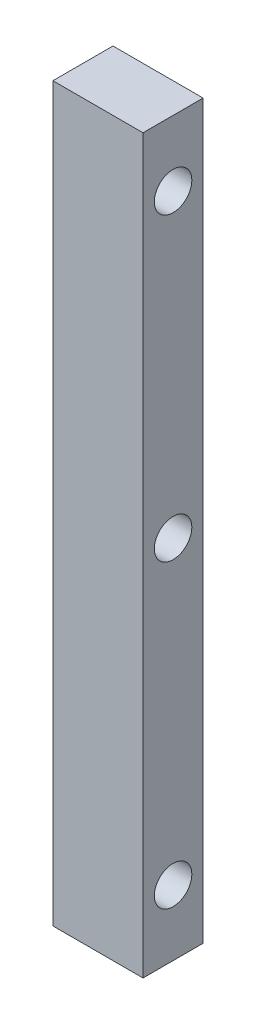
ISO-10303-21;
HEADER;
FILE_DESCRIPTION(('STEP AP214'),'2;1');
FILE_NAME('part.step','',(''),(''),'','','');
FILE_SCHEMA(('AUTOMOTIVE_DESIGN { 1 0 10303 214 1 1 1 1 }'));
ENDSEC;
DATA;
#1=APPLICATION_CONTEXT('core data for automotive mechanical design processes');
#2=APPLICATION_PROTOCOL_DEFINITION('international standard','automotive_design',2000,#1);
#3=PRODUCT_CONTEXT('',#1,'mechanical');
#4=PRODUCT('Part','Part','',(#3));
#5=PRODUCT_RELATED_PRODUCT_CATEGORY('part','',(#4));
#6=PRODUCT_DEFINITION_FORMATION('','',#4);
#7=PRODUCT_DEFINITION_CONTEXT('part definition',#1,'design');
#8=PRODUCT_DEFINITION('design','',#6,#7);
#9=PRODUCT_DEFINITION_SHAPE('','',#8);
#10=(LENGTH_UNIT() NAMED_UNIT(*) SI_UNIT(.MILLI.,.METRE.));
#11=(NAMED_UNIT(*) PLANE_ANGLE_UNIT() SI_UNIT($,.RADIAN.));
#12=(NAMED_UNIT(*) SI_UNIT($,.STERADIAN.) SOLID_ANGLE_UNIT());
#13=UNCERTAINTY_MEASURE_WITH_UNIT(LENGTH_MEASURE(1.E-05),#10,'distance_accuracy_value','');
#14=(GEOMETRIC_REPRESENTATION_CONTEXT(3) GLOBAL_UNCERTAINTY_ASSIGNED_CONTEXT((#13)) GLOBAL_UNIT_ASSIGNED_CONTEXT((#10,
#11,#12)) REPRESENTATION_CONTEXT('',''));
#15=CARTESIAN_POINT('',(0.,0.,0.));
#16=DIRECTION('',(0.,0.,1.));
#17=DIRECTION('',(1.,0.,0.));
#18=AXIS2_PLACEMENT_3D('',#15,#16,#17);
#19=CARTESIAN_POINT('',(-19.05,77.343,-12.6999999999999));
#20=DIRECTION('',(0.,0.,1.00000000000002));
#21=DIRECTION('',(1.,0.,0.));
#22=AXIS2_PLACEMENT_3D('',#19,#20,#21);
#23=PLANE('',#22);
#24=DIRECTION('',(0.,-1.00000000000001,0.));
#25=VECTOR('',#24,1.);
#26=CARTESIAN_POINT('',(0.,77.343,-12.6999999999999));
#27=LINE('',#26,#25);
#28=CARTESIAN_POINT('',(0.,77.343,-12.6999999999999));
#29=VERTEX_POINT('',#28);
#30=CARTESIAN_POINT('',(0.,-77.3430000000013,-12.6999999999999));
#31=VERTEX_POINT('',#30);
#32=EDGE_CURVE('E87',#29,#31,#27,.T.);
#33=ORIENTED_EDGE('',*,*,#32,.T.);
#34=DIRECTION('',(-1.,0.,0.));
#35=VECTOR('',#34,1.);
#36=CARTESIAN_POINT('',(-19.05,-77.3430000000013,-12.6999999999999));
#37=LINE('',#36,#35);
#38=CARTESIAN_POINT('',(-19.05,-77.3430000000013,-12.6999999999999));
#39=VERTEX_POINT('',#38);
#40=EDGE_CURVE('E82',#31,#39,#37,.T.);
#41=ORIENTED_EDGE('',*,*,#40,.T.);
#42=DIRECTION('',(0.,-1.00000000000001,0.));
#43=VECTOR('',#42,1.);
#44=CARTESIAN_POINT('',(-19.05,77.343,-12.6999999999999));
#45=LINE('',#44,#43);
#46=CARTESIAN_POINT('',(-19.05,77.343,-12.6999999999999));
#47=VERTEX_POINT('',#46);
#48=EDGE_CURVE('E11',#47,#39,#45,.T.);
#49=ORIENTED_EDGE('',*,*,#48,.F.);
#50=DIRECTION('',(-1.,0.,0.));
#51=VECTOR('',#50,1.);
#52=CARTESIAN_POINT('',(-19.05,77.343,-12.6999999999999));
#53=LINE('',#52,#51);
#54=EDGE_CURVE('E98',#29,#47,#53,.T.);
#55=ORIENTED_EDGE('',*,*,#54,.F.);
#56=EDGE_LOOP('',(#33,#41,#49,#55));
#57=FACE_BOUND('',#56,.T.);
#58=ADVANCED_FACE('F30',(#57),#23,.F.);
#59=CARTESIAN_POINT('',(-19.05,77.3430000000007,0.));
#60=DIRECTION('',(1.,0.,0.));
#61=DIRECTION('',(0.,0.,-1.00000000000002));
#62=AXIS2_PLACEMENT_3D('',#59,#60,#61);
#63=PLANE('',#62);
#64=CARTESIAN_POINT('',(-19.05,-63.5000000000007,-6.34999999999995));
#65=DIRECTION('',(1.,0.,0.));
#66=DIRECTION('',(0.,0.,-1.00000000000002));
#67=AXIS2_PLACEMENT_3D('',#64,#65,#66);
#68=CIRCLE('',#67,3.9624);
#69=CARTESIAN_POINT('',(-19.05,-63.5000000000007,-10.3124));
#70=VERTEX_POINT('',#69);
#71=EDGE_CURVE('E132',#70,#70,#68,.T.);
#72=ORIENTED_EDGE('',*,*,#71,.T.);
#73=EDGE_LOOP('',(#72));
#74=FACE_BOUND('',#73,.T.);
#75=CARTESIAN_POINT('',(-19.05,0.,-6.34999999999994));
#76=DIRECTION('',(1.,0.,0.));
#77=DIRECTION('',(0.,0.,-1.00000000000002));
#78=AXIS2_PLACEMENT_3D('',#75,#76,#77);
#79=CIRCLE('',#78,3.9624);
#80=CARTESIAN_POINT('',(-19.05,0.,-10.3124));
#81=VERTEX_POINT('',#80);
#82=EDGE_CURVE('E136',#81,#81,#79,.T.);
#83=ORIENTED_EDGE('',*,*,#82,.T.);
#84=EDGE_LOOP('',(#83));
#85=FACE_BOUND('',#84,.T.);
#86=CARTESIAN_POINT('',(-19.05,63.5000000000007,-6.3499999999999));
#87=DIRECTION('',(1.,0.,0.));
#88=DIRECTION('',(0.,0.,-1.00000000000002));
#89=AXIS2_PLACEMENT_3D('',#86,#87,#88);
#90=CIRCLE('',#89,3.9624);
#91=CARTESIAN_POINT('',(-19.05,63.5000000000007,-10.3124));
#92=VERTEX_POINT('',#91);
#93=EDGE_CURVE('E88',#92,#92,#90,.T.);
#94=ORIENTED_EDGE('',*,*,#93,.T.);
#95=EDGE_LOOP('',(#94));
#96=FACE_BOUND('',#95,.T.);
#97=ORIENTED_EDGE('',*,*,#48,.T.);
#98=DIRECTION('',(0.,0.,1.00000000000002));
#99=VECTOR('',#98,1.);
#100=CARTESIAN_POINT('',(-19.0500000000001,-77.3430000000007,0.));
#101=LINE('',#100,#99);
#102=CARTESIAN_POINT('',(-19.0500000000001,-77.3430000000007,0.));
#103=VERTEX_POINT('',#102);
#104=EDGE_CURVE('E72',#39,#103,#101,.T.);
#105=ORIENTED_EDGE('',*,*,#104,.T.);
#106=DIRECTION('',(0.,-1.00000000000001,0.));
#107=VECTOR('',#106,1.);
#108=CARTESIAN_POINT('',(-19.05,77.3430000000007,0.));
#109=LINE('',#108,#107);
#110=CARTESIAN_POINT('',(-19.05,77.3430000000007,0.));
#111=VERTEX_POINT('',#110);
#112=EDGE_CURVE('E37',#111,#103,#109,.T.);
#113=ORIENTED_EDGE('',*,*,#112,.F.);
#114=DIRECTION('',(0.,0.,1.00000000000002));
#115=VECTOR('',#114,1.);
#116=CARTESIAN_POINT('',(-19.05,77.3430000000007,0.));
#117=LINE('',#116,#115);
#118=EDGE_CURVE('E73',#47,#111,#117,.T.);
#119=ORIENTED_EDGE('',*,*,#118,.F.);
#120=EDGE_LOOP('',(#97,#105,#113,#119));
#121=FACE_BOUND('',#120,.T.);
#122=ADVANCED_FACE('F70',(#74,#85,#96,#121),#63,.F.);
#123=CARTESIAN_POINT('',(-19.05,77.3430000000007,0.));
#124=DIRECTION('',(0.,0.,-1.00000000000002));
#125=DIRECTION('',(-1.,0.,0.));
#126=AXIS2_PLACEMENT_3D('',#123,#124,#125);
#127=PLANE('',#126);
#128=ORIENTED_EDGE('',*,*,#112,.T.);
#129=DIRECTION('',(1.,0.,0.));
#130=VECTOR('',#129,1.);
#131=CARTESIAN_POINT('',(-19.0500000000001,-77.3430000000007,0.));
#132=LINE('',#131,#130);
#133=CARTESIAN_POINT('',(0.,-77.3430000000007,0.));
#134=VERTEX_POINT('',#133);
#135=EDGE_CURVE('E85',#103,#134,#132,.T.);
#136=ORIENTED_EDGE('',*,*,#135,.T.);
#137=DIRECTION('',(0.,-1.00000000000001,0.));
#138=VECTOR('',#137,1.);
#139=CARTESIAN_POINT('',(0.,77.3430000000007,0.));
#140=LINE('',#139,#138);
#141=CARTESIAN_POINT('',(0.,77.3430000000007,0.));
#142=VERTEX_POINT('',#141);
#143=EDGE_CURVE('E104',#142,#134,#140,.T.);
#144=ORIENTED_EDGE('',*,*,#143,.F.);
#145=DIRECTION('',(1.,0.,0.));
#146=VECTOR('',#145,1.);
#147=CARTESIAN_POINT('',(-19.05,77.3430000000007,0.));
#148=LINE('',#147,#146);
#149=EDGE_CURVE('E49',#111,#142,#148,.T.);
#150=ORIENTED_EDGE('',*,*,#149,.F.);
#151=EDGE_LOOP('',(#128,#136,#144,#150));
#152=FACE_BOUND('',#151,.T.);
#153=ADVANCED_FACE('F106',(#152),#127,.F.);
#154=CARTESIAN_POINT('',(0.,77.343,-12.6999999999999));
#155=DIRECTION('',(-1.,0.,0.));
#156=DIRECTION('',(0.,0.,1.00000000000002));
#157=AXIS2_PLACEMENT_3D('',#154,#155,#156);
#158=PLANE('',#157);
#159=CARTESIAN_POINT('',(0.,-63.5000000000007,-6.34999999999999));
#160=DIRECTION('',(1.,0.,0.));
#161=DIRECTION('',(0.,0.,-1.00000000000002));
#162=AXIS2_PLACEMENT_3D('',#159,#160,#161);
#163=CIRCLE('',#162,3.9624);
#164=CARTESIAN_POINT('',(0.,-63.5000000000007,-10.3124));
#165=VERTEX_POINT('',#164);
#166=EDGE_CURVE('E152',#165,#165,#163,.T.);
#167=ORIENTED_EDGE('',*,*,#166,.F.);
#168=EDGE_LOOP('',(#167));
#169=FACE_BOUND('',#168,.T.);
#170=CARTESIAN_POINT('',(0.,0.,-6.35000000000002));
#171=DIRECTION('',(1.,0.,0.));
#172=DIRECTION('',(0.,0.,-1.00000000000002));
#173=AXIS2_PLACEMENT_3D('',#170,#171,#172);
#174=CIRCLE('',#173,3.9624);
#175=CARTESIAN_POINT('',(0.,0.,-10.3124));
#176=VERTEX_POINT('',#175);
#177=EDGE_CURVE('E146',#176,#176,#174,.T.);
#178=ORIENTED_EDGE('',*,*,#177,.F.);
#179=EDGE_LOOP('',(#178));
#180=FACE_BOUND('',#179,.T.);
#181=CARTESIAN_POINT('',(-2.4980018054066E-13,63.5000000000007,-6.34999999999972));
#182=DIRECTION('',(1.,0.,0.));
#183=DIRECTION('',(0.,0.,-1.00000000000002));
#184=AXIS2_PLACEMENT_3D('',#181,#182,#183);
#185=CIRCLE('',#184,3.9624);
#186=CARTESIAN_POINT('',(-2.53269627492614E-13,63.5000000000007,-10.3124));
#187=VERTEX_POINT('',#186);
#188=EDGE_CURVE('E91',#187,#187,#185,.T.);
#189=ORIENTED_EDGE('',*,*,#188,.F.);
#190=EDGE_LOOP('',(#189));
#191=FACE_BOUND('',#190,.T.);
#192=ORIENTED_EDGE('',*,*,#143,.T.);
#193=DIRECTION('',(0.,0.,-1.00000000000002));
#194=VECTOR('',#193,1.);
#195=CARTESIAN_POINT('',(0.,-77.3430000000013,-12.6999999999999));
#196=LINE('',#195,#194);
#197=EDGE_CURVE('E96',#134,#31,#196,.T.);
#198=ORIENTED_EDGE('',*,*,#197,.T.);
#199=ORIENTED_EDGE('',*,*,#32,.F.);
#200=DIRECTION('',(0.,0.,-1.00000000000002));
#201=VECTOR('',#200,1.);
#202=CARTESIAN_POINT('',(0.,77.343,-12.6999999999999));
#203=LINE('',#202,#201);
#204=EDGE_CURVE('E44',#142,#29,#203,.T.);
#205=ORIENTED_EDGE('',*,*,#204,.F.);
#206=EDGE_LOOP('',(#192,#198,#199,#205));
#207=FACE_BOUND('',#206,.T.);
#208=ADVANCED_FACE('F108',(#169,#180,#191,#207),#158,.F.);
#209=CARTESIAN_POINT('',(0.,77.343,-12.6999999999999));
#210=DIRECTION('',(0.,-1.00000000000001,0.));
#211=DIRECTION('',(0.,0.,-1.00000000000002));
#212=AXIS2_PLACEMENT_3D('',#209,#210,#211);
#213=PLANE('',#212);
#214=ORIENTED_EDGE('',*,*,#54,.T.);
#215=ORIENTED_EDGE('',*,*,#118,.T.);
#216=ORIENTED_EDGE('',*,*,#149,.T.);
#217=ORIENTED_EDGE('',*,*,#204,.T.);
#218=EDGE_LOOP('',(#214,#215,#216,#217));
#219=FACE_BOUND('',#218,.T.);
#220=ADVANCED_FACE('F109',(#219),#213,.F.);
#221=CARTESIAN_POINT('',(0.,-77.3430000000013,-12.6999999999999));
#222=DIRECTION('',(0.,-1.00000000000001,0.));
#223=DIRECTION('',(0.,0.,-1.00000000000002));
#224=AXIS2_PLACEMENT_3D('',#221,#222,#223);
#225=PLANE('',#224);
#226=ORIENTED_EDGE('',*,*,#40,.F.);
#227=ORIENTED_EDGE('',*,*,#197,.F.);
#228=ORIENTED_EDGE('',*,*,#135,.F.);
#229=ORIENTED_EDGE('',*,*,#104,.F.);
#230=EDGE_LOOP('',(#226,#227,#228,#229));
#231=FACE_BOUND('',#230,.T.);
#232=ADVANCED_FACE('F80',(#231),#225,.T.);
#233=CARTESIAN_POINT('',(-19.05,63.5000000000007,-6.3499999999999));
#234=DIRECTION('',(1.,0.,0.));
#235=DIRECTION('',(0.,0.,-1.00000000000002));
#236=AXIS2_PLACEMENT_3D('',#233,#234,#235);
#237=CYLINDRICAL_SURFACE('',#236,3.9624);
#238=CARTESIAN_POINT('',(-19.05,63.5000000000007,-10.3124));
#239=CARTESIAN_POINT('',(-18.8515625,63.5000000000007,-10.3124));
#240=CARTESIAN_POINT('',(-18.653125,63.5000000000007,-10.3124));
#241=CARTESIAN_POINT('',(-18.25625,63.5000000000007,-10.3124));
#242=CARTESIAN_POINT('',(-18.0578125,63.5000000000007,-10.3124));
#243=CARTESIAN_POINT('',(-17.6609375,63.5000000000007,-10.3124));
#244=CARTESIAN_POINT('',(-17.4625,63.5000000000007,-10.3124));
#245=CARTESIAN_POINT('',(-17.065625,63.5000000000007,-10.3124));
#246=CARTESIAN_POINT('',(-16.8671875,63.5000000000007,-10.3124));
#247=CARTESIAN_POINT('',(-16.4703125,63.5000000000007,-10.3124));
#248=CARTESIAN_POINT('',(-16.2718750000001,63.5000000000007,-10.3124));
#249=CARTESIAN_POINT('',(-15.8750000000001,63.5000000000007,-10.3124));
#250=CARTESIAN_POINT('',(-15.6765625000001,63.5000000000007,-10.3124));
#251=CARTESIAN_POINT('',(-15.2796875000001,63.5000000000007,-10.3124));
#252=CARTESIAN_POINT('',(-15.0812500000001,63.5000000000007,-10.3124));
#253=CARTESIAN_POINT('',(-14.6843750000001,63.5000000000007,-10.3124));
#254=CARTESIAN_POINT('',(-14.4859375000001,63.5000000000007,-10.3124));
#255=CARTESIAN_POINT('',(-14.0890625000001,63.5000000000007,-10.3124));
#256=CARTESIAN_POINT('',(-13.8906250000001,63.5000000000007,-10.3124));
#257=CARTESIAN_POINT('',(-13.4937500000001,63.5000000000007,-10.3124));
#258=CARTESIAN_POINT('',(-13.2953125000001,63.5000000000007,-10.3124));
#259=CARTESIAN_POINT('',(-12.8984375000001,63.5000000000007,-10.3124));
#260=CARTESIAN_POINT('',(-12.7000000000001,63.5000000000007,-10.3124));
#261=CARTESIAN_POINT('',(-12.3031250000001,63.5000000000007,-10.3124));
#262=CARTESIAN_POINT('',(-12.1046875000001,63.5000000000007,-10.3124));
#263=CARTESIAN_POINT('',(-11.7078125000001,63.5000000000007,-10.3124));
#264=CARTESIAN_POINT('',(-11.5093750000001,63.5000000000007,-10.3124));
#265=CARTESIAN_POINT('',(-11.1125000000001,63.5000000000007,-10.3124));
#266=CARTESIAN_POINT('',(-10.9140625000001,63.5000000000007,-10.3124));
#267=CARTESIAN_POINT('',(-10.5171875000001,63.5000000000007,-10.3124));
#268=CARTESIAN_POINT('',(-10.3187500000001,63.5000000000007,-10.3124));
#269=CARTESIAN_POINT('',(-9.92187500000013,63.5000000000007,-10.3124));
#270=CARTESIAN_POINT('',(-9.72343750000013,63.5000000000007,-10.3124));
#271=CARTESIAN_POINT('',(-9.32656250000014,63.5000000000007,-10.3124));
#272=CARTESIAN_POINT('',(-9.12812500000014,63.5000000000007,-10.3124));
#273=CARTESIAN_POINT('',(-8.73125000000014,63.5000000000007,-10.3124));
#274=CARTESIAN_POINT('',(-8.53281250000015,63.5000000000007,-10.3124));
#275=CARTESIAN_POINT('',(-8.13593750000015,63.5000000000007,-10.3124));
#276=CARTESIAN_POINT('',(-7.93750000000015,63.5000000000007,-10.3124));
#277=CARTESIAN_POINT('',(-7.54062500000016,63.5000000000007,-10.3124));
#278=CARTESIAN_POINT('',(-7.34218750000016,63.5000000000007,-10.3124));
#279=CARTESIAN_POINT('',(-6.94531250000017,63.5000000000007,-10.3124));
#280=CARTESIAN_POINT('',(-6.74687500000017,63.5000000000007,-10.3124));
#281=CARTESIAN_POINT('',(-6.35000000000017,63.5000000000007,-10.3124));
#282=CARTESIAN_POINT('',(-6.15156250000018,63.5000000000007,-10.3124));
#283=CARTESIAN_POINT('',(-5.75468750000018,63.5000000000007,-10.3124));
#284=CARTESIAN_POINT('',(-5.55625000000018,63.5000000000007,-10.3124));
#285=CARTESIAN_POINT('',(-5.15937500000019,63.5000000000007,-10.3124));
#286=CARTESIAN_POINT('',(-4.96093750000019,63.5000000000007,-10.3124));
#287=CARTESIAN_POINT('',(-4.5640625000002,63.5000000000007,-10.3124));
#288=CARTESIAN_POINT('',(-4.3656250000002,63.5000000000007,-10.3124));
#289=CARTESIAN_POINT('',(-3.9687500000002,63.5000000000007,-10.3124));
#290=CARTESIAN_POINT('',(-3.77031250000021,63.5000000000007,-10.3124));
#291=CARTESIAN_POINT('',(-3.37343750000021,63.5000000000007,-10.3124));
#292=CARTESIAN_POINT('',(-3.17500000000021,63.5000000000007,-10.3124));
#293=CARTESIAN_POINT('',(-2.77812500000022,63.5000000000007,-10.3124));
#294=CARTESIAN_POINT('',(-2.57968750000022,63.5000000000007,-10.3124));
#295=CARTESIAN_POINT('',(-2.18281250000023,63.5000000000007,-10.3124));
#296=CARTESIAN_POINT('',(-1.98437500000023,63.5000000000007,-10.3124));
#297=CARTESIAN_POINT('',(-1.58750000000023,63.5000000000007,-10.3124));
#298=CARTESIAN_POINT('',(-1.38906250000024,63.5000000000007,-10.3124));
#299=CARTESIAN_POINT('',(-0.992187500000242,63.5000000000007,-10.3124));
#300=CARTESIAN_POINT('',(-0.793750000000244,63.5000000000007,-10.3124));
#301=CARTESIAN_POINT('',(-0.396875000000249,63.5000000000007,-10.3124));
#302=CARTESIAN_POINT('',(-0.198437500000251,63.5000000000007,-10.3124));
#303=CARTESIAN_POINT('',(-2.53269627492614E-13,63.5000000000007,-10.3124));
#304=B_SPLINE_CURVE_WITH_KNOTS('',3,(#238,#239,#240,#241,#242,#243,#244,#245,#246,#247,#248,
#249,#250,#251,#252,#253,#254,#255,#256,#257,#258,#259,#260,#261,#262,#263,#264,#265,#266,#267,
#268,#269,#270,#271,#272,#273,#274,#275,#276,#277,#278,#279,#280,#281,#282,#283,#284,#285,#286,
#287,#288,#289,#290,#291,#292,#293,#294,#295,#296,#297,#298,#299,#300,#301,#302,#303),
.UNSPECIFIED.,.F.,.F.,(4,2,2,2,2,2,2,2,2,2,2,2,2,2,2,2,2,2,2,2,2,2,2,2,2,2,2,2,2,2,2,2,4),(0.,
0.59531249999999,1.19062499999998,1.78593749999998,2.38124999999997,2.97656249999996,
3.57187499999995,4.16718749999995,4.76249999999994,5.35781249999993,5.95312499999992,
6.54843749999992,7.14374999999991,7.7390624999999,8.33437499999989,8.92968749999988,
9.52499999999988,10.1203124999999,10.7156249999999,11.3109374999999,11.9062499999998,
12.5015624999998,13.0968749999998,13.6921874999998,14.2874999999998,14.8828124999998,
15.4781249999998,16.0734374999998,16.6687499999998,17.2640624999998,17.8593749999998,
18.4546874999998,19.0499999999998),.UNSPECIFIED.);
#305=EDGE_CURVE('BSEAM116',#92,#187,#304,.T.);
#306=ORIENTED_EDGE('',*,*,#93,.F.);
#307=ORIENTED_EDGE('',*,*,#188,.T.);
#308=ORIENTED_EDGE('',*,*,#305,.T.);
#309=ORIENTED_EDGE('',*,*,#305,.F.);
#310=EDGE_LOOP('',(#306,#308,#307,#309));
#311=FACE_BOUND('',#310,.T.);
#312=ADVANCED_FACE('F116',(#311),#237,.F.);
#313=CARTESIAN_POINT('',(-19.05,0.,-6.34999999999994));
#314=DIRECTION('',(1.,0.,0.));
#315=DIRECTION('',(0.,0.,-1.00000000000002));
#316=AXIS2_PLACEMENT_3D('',#313,#314,#315);
#317=CYLINDRICAL_SURFACE('',#316,3.9624);
#318=CARTESIAN_POINT('',(-19.05,0.,-10.3124));
#319=CARTESIAN_POINT('',(-18.8515625,0.,-10.3124));
#320=CARTESIAN_POINT('',(-18.653125,0.,-10.3124));
#321=CARTESIAN_POINT('',(-18.25625,0.,-10.3124));
#322=CARTESIAN_POINT('',(-18.0578125,0.,-10.3124));
#323=CARTESIAN_POINT('',(-17.6609375,0.,-10.3124));
#324=CARTESIAN_POINT('',(-17.4625,0.,-10.3124));
#325=CARTESIAN_POINT('',(-17.065625,0.,-10.3124));
#326=CARTESIAN_POINT('',(-16.8671875,0.,-10.3124));
#327=CARTESIAN_POINT('',(-16.4703125,0.,-10.3124));
#328=CARTESIAN_POINT('',(-16.271875,0.,-10.3124));
#329=CARTESIAN_POINT('',(-15.875,0.,-10.3124));
#330=CARTESIAN_POINT('',(-15.6765625,0.,-10.3124));
#331=CARTESIAN_POINT('',(-15.2796875,0.,-10.3124));
#332=CARTESIAN_POINT('',(-15.08125,0.,-10.3124));
#333=CARTESIAN_POINT('',(-14.684375,0.,-10.3124));
#334=CARTESIAN_POINT('',(-14.4859375,0.,-10.3124));
#335=CARTESIAN_POINT('',(-14.0890625,0.,-10.3124));
#336=CARTESIAN_POINT('',(-13.890625,0.,-10.3124));
#337=CARTESIAN_POINT('',(-13.49375,0.,-10.3124));
#338=CARTESIAN_POINT('',(-13.2953125,0.,-10.3124));
#339=CARTESIAN_POINT('',(-12.8984375,0.,-10.3124));
#340=CARTESIAN_POINT('',(-12.7,0.,-10.3124));
#341=CARTESIAN_POINT('',(-12.303125,0.,-10.3124));
#342=CARTESIAN_POINT('',(-12.1046875,0.,-10.3124));
#343=CARTESIAN_POINT('',(-11.7078125,0.,-10.3124));
#344=CARTESIAN_POINT('',(-11.509375,0.,-10.3124));
#345=CARTESIAN_POINT('',(-11.1125,0.,-10.3124));
#346=CARTESIAN_POINT('',(-10.9140625,0.,-10.3124));
#347=CARTESIAN_POINT('',(-10.5171875,0.,-10.3124));
#348=CARTESIAN_POINT('',(-10.31875,0.,-10.3124));
#349=CARTESIAN_POINT('',(-9.92187500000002,0.,-10.3124));
#350=CARTESIAN_POINT('',(-9.72343750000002,0.,-10.3124));
#351=CARTESIAN_POINT('',(-9.32656250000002,0.,-10.3124));
#352=CARTESIAN_POINT('',(-9.12812500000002,0.,-10.3124));
#353=CARTESIAN_POINT('',(-8.73125000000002,0.,-10.3124));
#354=CARTESIAN_POINT('',(-8.53281250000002,0.,-10.3124));
#355=CARTESIAN_POINT('',(-8.13593750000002,0.,-10.3124));
#356=CARTESIAN_POINT('',(-7.93750000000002,0.,-10.3124));
#357=CARTESIAN_POINT('',(-7.54062500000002,0.,-10.3124));
#358=CARTESIAN_POINT('',(-7.34218750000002,0.,-10.3124));
#359=CARTESIAN_POINT('',(-6.94531250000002,0.,-10.3124));
#360=CARTESIAN_POINT('',(-6.74687500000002,0.,-10.3124));
#361=CARTESIAN_POINT('',(-6.35000000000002,0.,-10.3124));
#362=CARTESIAN_POINT('',(-6.15156250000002,0.,-10.3124));
#363=CARTESIAN_POINT('',(-5.75468750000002,0.,-10.3124));
#364=CARTESIAN_POINT('',(-5.55625000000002,0.,-10.3124));
#365=CARTESIAN_POINT('',(-5.15937500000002,0.,-10.3124));
#366=CARTESIAN_POINT('',(-4.96093750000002,0.,-10.3124));
#367=CARTESIAN_POINT('',(-4.56406250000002,0.,-10.3124));
#368=CARTESIAN_POINT('',(-4.36562500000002,0.,-10.3124));
#369=CARTESIAN_POINT('',(-3.96875000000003,0.,-10.3124));
#370=CARTESIAN_POINT('',(-3.77031250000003,0.,-10.3124));
#371=CARTESIAN_POINT('',(-3.37343750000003,0.,-10.3124));
#372=CARTESIAN_POINT('',(-3.17500000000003,0.,-10.3124));
#373=CARTESIAN_POINT('',(-2.77812500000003,0.,-10.3124));
#374=CARTESIAN_POINT('',(-2.57968750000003,0.,-10.3124));
#375=CARTESIAN_POINT('',(-2.18281250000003,0.,-10.3124));
#376=CARTESIAN_POINT('',(-1.98437500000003,0.,-10.3124));
#377=CARTESIAN_POINT('',(-1.58750000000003,0.,-10.3124));
#378=CARTESIAN_POINT('',(-1.38906250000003,0.,-10.3124));
#379=CARTESIAN_POINT('',(-0.992187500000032,0.,-10.3124));
#380=CARTESIAN_POINT('',(-0.793750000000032,0.,-10.3124));
#381=CARTESIAN_POINT('',(-0.396875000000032,0.,-10.3124));
#382=CARTESIAN_POINT('',(-0.198437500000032,0.,-10.3124));
#383=CARTESIAN_POINT('',(0.,0.,-10.3124));
#384=B_SPLINE_CURVE_WITH_KNOTS('',3,(#318,#319,#320,#321,#322,#323,#324,#325,#326,#327,#328,
#329,#330,#331,#332,#333,#334,#335,#336,#337,#338,#339,#340,#341,#342,#343,#344,#345,#346,#347,
#348,#349,#350,#351,#352,#353,#354,#355,#356,#357,#358,#359,#360,#361,#362,#363,#364,#365,#366,
#367,#368,#369,#370,#371,#372,#373,#374,#375,#376,#377,#378,#379,#380,#381,#382,#383),
.UNSPECIFIED.,.F.,.F.,(4,2,2,2,2,2,2,2,2,2,2,2,2,2,2,2,2,2,2,2,2,2,2,2,2,2,2,2,2,2,2,2,4),(0.,
0.5953125,1.190625,1.7859375,2.38125,2.9765625,3.571875,4.1671875,4.7625,5.3578125,5.953125,
6.5484375,7.14375,7.7390625,8.33437499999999,8.92968749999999,9.52499999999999,10.1203125,
10.715625,11.3109375,11.90625,12.5015625,13.096875,13.6921875,14.2875,14.8828125,15.478125,
16.0734375,16.66875,17.2640625,17.859375,18.4546875,19.05),.UNSPECIFIED.);
#385=EDGE_CURVE('BSEAM141',#81,#176,#384,.T.);
#386=ORIENTED_EDGE('',*,*,#82,.F.);
#387=ORIENTED_EDGE('',*,*,#177,.T.);
#388=ORIENTED_EDGE('',*,*,#385,.T.);
#389=ORIENTED_EDGE('',*,*,#385,.F.);
#390=EDGE_LOOP('',(#386,#388,#387,#389));
#391=FACE_BOUND('',#390,.T.);
#392=ADVANCED_FACE('F141',(#391),#317,.F.);
#393=CARTESIAN_POINT('',(-19.05,-63.5000000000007,-6.34999999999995));
#394=DIRECTION('',(1.,0.,0.));
#395=DIRECTION('',(0.,0.,-1.00000000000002));
#396=AXIS2_PLACEMENT_3D('',#393,#394,#395);
#397=CYLINDRICAL_SURFACE('',#396,3.9624);
#398=CARTESIAN_POINT('',(-19.05,-63.5000000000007,-10.3124));
#399=CARTESIAN_POINT('',(-18.8515625,-63.5000000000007,-10.3124));
#400=CARTESIAN_POINT('',(-18.653125,-63.5000000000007,-10.3124));
#401=CARTESIAN_POINT('',(-18.25625,-63.5000000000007,-10.3124));
#402=CARTESIAN_POINT('',(-18.0578125,-63.5000000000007,-10.3124));
#403=CARTESIAN_POINT('',(-17.6609375,-63.5000000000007,-10.3124));
#404=CARTESIAN_POINT('',(-17.4625,-63.5000000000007,-10.3124));
#405=CARTESIAN_POINT('',(-17.065625,-63.5000000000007,-10.3124));
#406=CARTESIAN_POINT('',(-16.8671875,-63.5000000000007,-10.3124));
#407=CARTESIAN_POINT('',(-16.4703125,-63.5000000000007,-10.3124));
#408=CARTESIAN_POINT('',(-16.271875,-63.5000000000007,-10.3124));
#409=CARTESIAN_POINT('',(-15.875,-63.5000000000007,-10.3124));
#410=CARTESIAN_POINT('',(-15.6765625,-63.5000000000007,-10.3124));
#411=CARTESIAN_POINT('',(-15.2796875,-63.5000000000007,-10.3124));
#412=CARTESIAN_POINT('',(-15.08125,-63.5000000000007,-10.3124));
#413=CARTESIAN_POINT('',(-14.6843750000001,-63.5000000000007,-10.3124));
#414=CARTESIAN_POINT('',(-14.4859375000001,-63.5000000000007,-10.3124));
#415=CARTESIAN_POINT('',(-14.0890625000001,-63.5000000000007,-10.3124));
#416=CARTESIAN_POINT('',(-13.8906250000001,-63.5000000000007,-10.3124));
#417=CARTESIAN_POINT('',(-13.4937500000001,-63.5000000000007,-10.3124));
#418=CARTESIAN_POINT('',(-13.2953125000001,-63.5000000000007,-10.3124));
#419=CARTESIAN_POINT('',(-12.8984375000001,-63.5000000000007,-10.3124));
#420=CARTESIAN_POINT('',(-12.7000000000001,-63.5000000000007,-10.3124));
#421=CARTESIAN_POINT('',(-12.3031250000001,-63.5000000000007,-10.3124));
#422=CARTESIAN_POINT('',(-12.1046875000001,-63.5000000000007,-10.3124));
#423=CARTESIAN_POINT('',(-11.7078125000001,-63.5000000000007,-10.3124));
#424=CARTESIAN_POINT('',(-11.5093750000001,-63.5000000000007,-10.3124));
#425=CARTESIAN_POINT('',(-11.1125000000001,-63.5000000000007,-10.3124));
#426=CARTESIAN_POINT('',(-10.9140625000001,-63.5000000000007,-10.3124));
#427=CARTESIAN_POINT('',(-10.5171875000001,-63.5000000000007,-10.3124));
#428=CARTESIAN_POINT('',(-10.3187500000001,-63.5000000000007,-10.3124));
#429=CARTESIAN_POINT('',(-9.92187500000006,-63.5000000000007,-10.3124));
#430=CARTESIAN_POINT('',(-9.72343750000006,-63.5000000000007,-10.3124));
#431=CARTESIAN_POINT('',(-9.32656250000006,-63.5000000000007,-10.3124));
#432=CARTESIAN_POINT('',(-9.12812500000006,-63.5000000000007,-10.3124));
#433=CARTESIAN_POINT('',(-8.73125000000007,-63.5000000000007,-10.3124));
#434=CARTESIAN_POINT('',(-8.53281250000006,-63.5000000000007,-10.3124));
#435=CARTESIAN_POINT('',(-8.13593750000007,-63.5000000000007,-10.3124));
#436=CARTESIAN_POINT('',(-7.93750000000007,-63.5000000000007,-10.3124));
#437=CARTESIAN_POINT('',(-7.54062500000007,-63.5000000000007,-10.3124));
#438=CARTESIAN_POINT('',(-7.34218750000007,-63.5000000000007,-10.3124));
#439=CARTESIAN_POINT('',(-6.94531250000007,-63.5000000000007,-10.3124));
#440=CARTESIAN_POINT('',(-6.74687500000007,-63.5000000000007,-10.3124));
#441=CARTESIAN_POINT('',(-6.35000000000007,-63.5000000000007,-10.3124));
#442=CARTESIAN_POINT('',(-6.15156250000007,-63.5000000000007,-10.3124));
#443=CARTESIAN_POINT('',(-5.75468750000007,-63.5000000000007,-10.3124));
#444=CARTESIAN_POINT('',(-5.55625000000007,-63.5000000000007,-10.3124));
#445=CARTESIAN_POINT('',(-5.15937500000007,-63.5000000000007,-10.3124));
#446=CARTESIAN_POINT('',(-4.96093750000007,-63.5000000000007,-10.3124));
#447=CARTESIAN_POINT('',(-4.56406250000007,-63.5000000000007,-10.3124));
#448=CARTESIAN_POINT('',(-4.36562500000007,-63.5000000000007,-10.3124));
#449=CARTESIAN_POINT('',(-3.96875000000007,-63.5000000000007,-10.3124));
#450=CARTESIAN_POINT('',(-3.77031250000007,-63.5000000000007,-10.3124));
#451=CARTESIAN_POINT('',(-3.37343750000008,-63.5000000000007,-10.3124));
#452=CARTESIAN_POINT('',(-3.17500000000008,-63.5000000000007,-10.3124));
#453=CARTESIAN_POINT('',(-2.77812500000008,-63.5000000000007,-10.3124));
#454=CARTESIAN_POINT('',(-2.57968750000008,-63.5000000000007,-10.3124));
#455=CARTESIAN_POINT('',(-2.18281250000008,-63.5000000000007,-10.3124));
#456=CARTESIAN_POINT('',(-1.98437500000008,-63.5000000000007,-10.3124));
#457=CARTESIAN_POINT('',(-1.58750000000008,-63.5000000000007,-10.3124));
#458=CARTESIAN_POINT('',(-1.38906250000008,-63.5000000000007,-10.3124));
#459=CARTESIAN_POINT('',(-0.992187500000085,-63.5000000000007,-10.3124));
#460=CARTESIAN_POINT('',(-0.793750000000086,-63.5000000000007,-10.3124));
#461=CARTESIAN_POINT('',(-0.396875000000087,-63.5000000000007,-10.3124));
#462=CARTESIAN_POINT('',(-0.198437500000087,-63.5000000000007,-10.3124));
#463=CARTESIAN_POINT('',(0.,-63.5000000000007,-10.3124));
#464=B_SPLINE_CURVE_WITH_KNOTS('',3,(#398,#399,#400,#401,#402,#403,#404,#405,#406,#407,#408,
#409,#410,#411,#412,#413,#414,#415,#416,#417,#418,#419,#420,#421,#422,#423,#424,#425,#426,#427,
#428,#429,#430,#431,#432,#433,#434,#435,#436,#437,#438,#439,#440,#441,#442,#443,#444,#445,#446,
#447,#448,#449,#450,#451,#452,#453,#454,#455,#456,#457,#458,#459,#460,#461,#462,#463),
.UNSPECIFIED.,.F.,.F.,(4,2,2,2,2,2,2,2,2,2,2,2,2,2,2,2,2,2,2,2,2,2,2,2,2,2,2,2,2,2,2,2,4),(0.,
0.5953125,1.190625,1.7859375,2.38125,2.97656249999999,3.57187499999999,4.16718749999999,
4.76249999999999,5.35781249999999,5.95312499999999,6.54843749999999,7.14374999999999,
7.73906249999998,8.33437499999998,8.92968749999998,9.52499999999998,10.1203125,10.715625,
11.3109375,11.90625,12.5015625,13.096875,13.6921875,14.2875,14.8828125,15.478125,16.0734375,
16.66875,17.2640625,17.859375,18.4546875,19.05),.UNSPECIFIED.);
#465=EDGE_CURVE('BSEAM156',#70,#165,#464,.T.);
#466=ORIENTED_EDGE('',*,*,#71,.F.);
#467=ORIENTED_EDGE('',*,*,#166,.T.);
#468=ORIENTED_EDGE('',*,*,#465,.T.);
#469=ORIENTED_EDGE('',*,*,#465,.F.);
#470=EDGE_LOOP('',(#466,#468,#467,#469));
#471=FACE_BOUND('',#470,.T.);
#472=ADVANCED_FACE('F156',(#471),#397,.F.);
#473=CLOSED_SHELL('',(#58,#122,#153,#208,#220,#232,#312,#392,#472));
#474=MANIFOLD_SOLID_BREP('B2',#473);
#475=ADVANCED_BREP_SHAPE_REPRESENTATION('',(#18,#474),#14);
#476=SHAPE_DEFINITION_REPRESENTATION(#9,#475);
ENDSEC;
END-ISO-10303-21;
